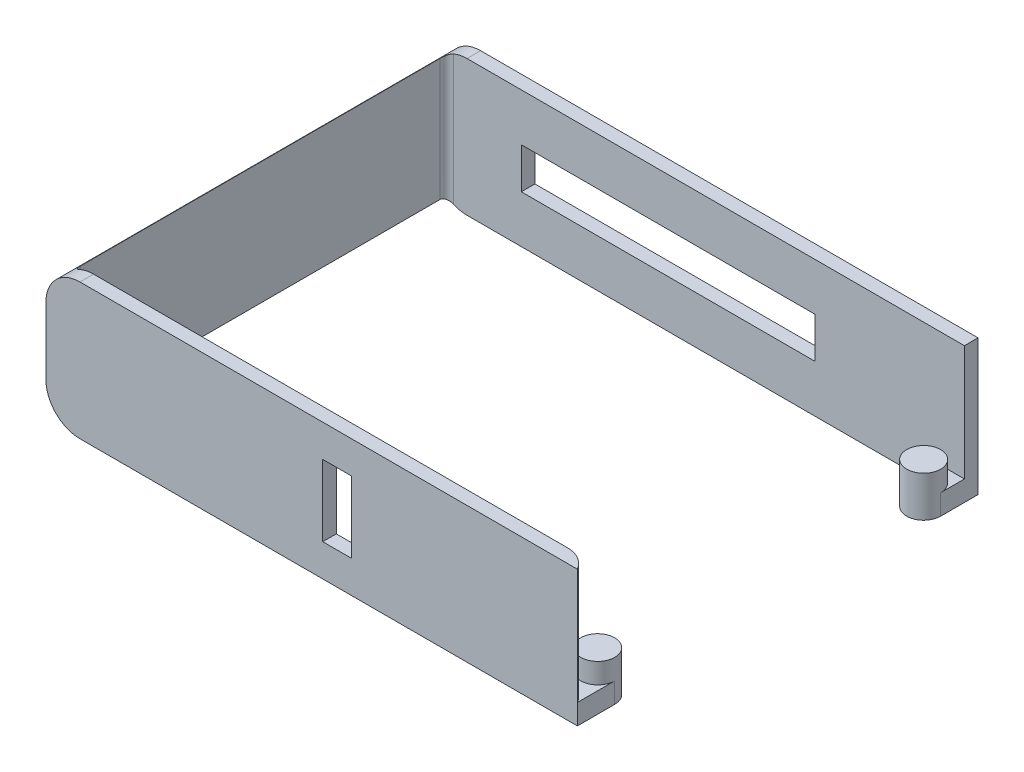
ISO-10303-21;
HEADER;
FILE_DESCRIPTION(('STEP AP214'),'2;1');
FILE_NAME('part.step','',(''),(''),'','','');
FILE_SCHEMA(('AUTOMOTIVE_DESIGN { 1 0 10303 214 1 1 1 1 }'));
ENDSEC;
DATA;
#1=APPLICATION_CONTEXT('core data for automotive mechanical design processes');
#2=APPLICATION_PROTOCOL_DEFINITION('international standard','automotive_design',2000,#1);
#3=PRODUCT_CONTEXT('',#1,'mechanical');
#4=PRODUCT('Part','Part','',(#3));
#5=PRODUCT_RELATED_PRODUCT_CATEGORY('part','',(#4));
#6=PRODUCT_DEFINITION_FORMATION('','',#4);
#7=PRODUCT_DEFINITION_CONTEXT('part definition',#1,'design');
#8=PRODUCT_DEFINITION('design','',#6,#7);
#9=PRODUCT_DEFINITION_SHAPE('','',#8);
#10=(LENGTH_UNIT() NAMED_UNIT(*) SI_UNIT(.MILLI.,.METRE.));
#11=(NAMED_UNIT(*) PLANE_ANGLE_UNIT() SI_UNIT($,.RADIAN.));
#12=(NAMED_UNIT(*) SI_UNIT($,.STERADIAN.) SOLID_ANGLE_UNIT());
#13=UNCERTAINTY_MEASURE_WITH_UNIT(LENGTH_MEASURE(1.E-05),#10,'distance_accuracy_value','');
#14=(GEOMETRIC_REPRESENTATION_CONTEXT(3) GLOBAL_UNCERTAINTY_ASSIGNED_CONTEXT((#13)) GLOBAL_UNIT_ASSIGNED_CONTEXT((#10,
#11,#12)) REPRESENTATION_CONTEXT('',''));
#15=CARTESIAN_POINT('',(0.,0.,0.));
#16=DIRECTION('',(0.,0.,1.));
#17=DIRECTION('',(1.,0.,0.));
#18=AXIS2_PLACEMENT_3D('',#15,#16,#17);
#19=CARTESIAN_POINT('',(-39.125,20.,2.));
#20=DIRECTION('',(0.,-1.,0.));
#21=DIRECTION('',(1.,0.,0.));
#22=AXIS2_PLACEMENT_3D('',#19,#20,#21);
#23=PLANE('',#22);
#24=DIRECTION('',(-1.,0.,0.));
#25=VECTOR('',#24,1.);
#26=CARTESIAN_POINT('',(-39.125,20.,0.));
#27=LINE('',#26,#25);
#28=CARTESIAN_POINT('',(39.125,20.,0.));
#29=VERTEX_POINT('',#28);
#30=CARTESIAN_POINT('',(-34.125,20.,0.));
#31=VERTEX_POINT('',#30);
#32=EDGE_CURVE('E548',#29,#31,#27,.T.);
#33=ORIENTED_EDGE('',*,*,#32,.T.);
#34=DIRECTION('',(0.,0.,-1.));
#35=VECTOR('',#34,1.);
#36=CARTESIAN_POINT('',(-34.125,20.,2.));
#37=LINE('',#36,#35);
#38=CARTESIAN_POINT('',(-34.125,20.,2.));
#39=VERTEX_POINT('',#38);
#40=EDGE_CURVE('E357',#31,#39,#37,.F.);
#41=ORIENTED_EDGE('',*,*,#40,.T.);
#42=DIRECTION('',(-1.,0.,0.));
#43=VECTOR('',#42,1.);
#44=CARTESIAN_POINT('',(-39.125,20.,2.));
#45=LINE('',#44,#43);
#46=CARTESIAN_POINT('',(39.125,20.,2.));
#47=VERTEX_POINT('',#46);
#48=EDGE_CURVE('E526',#47,#39,#45,.T.);
#49=ORIENTED_EDGE('',*,*,#48,.F.);
#50=DIRECTION('',(0.,0.,-1.));
#51=VECTOR('',#50,1.);
#52=CARTESIAN_POINT('',(39.125,20.,2.));
#53=LINE('',#52,#51);
#54=EDGE_CURVE('E533',#47,#29,#53,.T.);
#55=ORIENTED_EDGE('',*,*,#54,.T.);
#56=EDGE_LOOP('',(#33,#41,#49,#55));
#57=FACE_BOUND('',#56,.T.);
#58=ADVANCED_FACE('F27',(#57),#23,.F.);
#59=CARTESIAN_POINT('',(-39.125,0.,2.));
#60=DIRECTION('',(0.,1.,0.));
#61=DIRECTION('',(0.,0.,1.));
#62=AXIS2_PLACEMENT_3D('',#59,#60,#61);
#63=PLANE('',#62);
#64=DIRECTION('',(1.,0.,0.));
#65=VECTOR('',#64,1.);
#66=CARTESIAN_POINT('',(-39.125,0.,59.));
#67=LINE('',#66,#65);
#68=CARTESIAN_POINT('',(-34.125,0.,59.));
#69=VERTEX_POINT('',#68);
#70=CARTESIAN_POINT('',(39.125,0.,59.));
#71=VERTEX_POINT('',#70);
#72=EDGE_CURVE('E562',#69,#71,#67,.T.);
#73=ORIENTED_EDGE('',*,*,#72,.F.);
#74=DIRECTION('',(0.,0.,-1.));
#75=VECTOR('',#74,1.);
#76=CARTESIAN_POINT('',(-34.125,0.,2.));
#77=LINE('',#76,#75);
#78=CARTESIAN_POINT('',(-34.125,0.,57.));
#79=VERTEX_POINT('',#78);
#80=EDGE_CURVE('E321',#69,#79,#77,.T.);
#81=ORIENTED_EDGE('',*,*,#80,.T.);
#82=DIRECTION('',(1.,0.,0.));
#83=VECTOR('',#82,1.);
#84=CARTESIAN_POINT('',(-39.125,0.,57.));
#85=LINE('',#84,#83);
#86=CARTESIAN_POINT('',(34.125,0.,57.));
#87=VERTEX_POINT('',#86);
#88=EDGE_CURVE('E307',#79,#87,#85,.T.);
#89=ORIENTED_EDGE('',*,*,#88,.T.);
#90=DIRECTION('',(0.,0.,-1.));
#91=VECTOR('',#90,1.);
#92=CARTESIAN_POINT('',(34.125,0.,57.));
#93=LINE('',#92,#91);
#94=CARTESIAN_POINT('',(34.125,0.,53.5));
#95=VERTEX_POINT('',#94);
#96=EDGE_CURVE('E289',#87,#95,#93,.T.);
#97=ORIENTED_EDGE('',*,*,#96,.T.);
#98=CARTESIAN_POINT('',(36.625,0.,53.5));
#99=DIRECTION('',(0.,-1.,0.));
#100=DIRECTION('',(0.,0.,-1.));
#101=AXIS2_PLACEMENT_3D('',#98,#99,#100);
#102=CIRCLE('',#101,2.50000000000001);
#103=CARTESIAN_POINT('',(39.125,0.,53.5));
#104=VERTEX_POINT('',#103);
#105=EDGE_CURVE('E286',#95,#104,#102,.T.);
#106=ORIENTED_EDGE('',*,*,#105,.T.);
#107=DIRECTION('',(0.,0.,-1.));
#108=VECTOR('',#107,1.);
#109=CARTESIAN_POINT('',(39.125,0.,59.));
#110=LINE('',#109,#108);
#111=EDGE_CURVE('E476',#71,#104,#110,.T.);
#112=ORIENTED_EDGE('',*,*,#111,.F.);
#113=EDGE_LOOP('',(#73,#81,#89,#97,#106,#112));
#114=FACE_BOUND('',#113,.T.);
#115=ADVANCED_FACE('F445',(#114),#63,.F.);
#116=CARTESIAN_POINT('',(36.625,3.,5.5));
#117=DIRECTION('',(0.,1.,0.));
#118=DIRECTION('',(0.,0.,1.));
#119=AXIS2_PLACEMENT_3D('',#116,#117,#118);
#120=PLANE('',#119);
#121=DIRECTION('',(0.,0.,1.));
#122=VECTOR('',#121,1.);
#123=CARTESIAN_POINT('',(34.125,3.,2.));
#124=LINE('',#123,#122);
#125=CARTESIAN_POINT('',(34.125,3.,2.));
#126=VERTEX_POINT('',#125);
#127=CARTESIAN_POINT('',(34.125,3.,5.5));
#128=VERTEX_POINT('',#127);
#129=EDGE_CURVE('E496',#126,#128,#124,.T.);
#130=ORIENTED_EDGE('',*,*,#129,.T.);
#131=CARTESIAN_POINT('',(36.625,3.,5.5));
#132=DIRECTION('',(0.,1.,0.));
#133=DIRECTION('',(0.,0.,1.));
#134=AXIS2_PLACEMENT_3D('',#131,#132,#133);
#135=CIRCLE('',#134,2.50000000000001);
#136=CARTESIAN_POINT('',(39.125,3.,5.5));
#137=VERTEX_POINT('',#136);
#138=EDGE_CURVE('E479',#137,#128,#135,.T.);
#139=ORIENTED_EDGE('',*,*,#138,.F.);
#140=DIRECTION('',(0.,0.,-1.));
#141=VECTOR('',#140,1.);
#142=CARTESIAN_POINT('',(39.125,3.,2.));
#143=LINE('',#142,#141);
#144=CARTESIAN_POINT('',(39.125,3.,2.));
#145=VERTEX_POINT('',#144);
#146=EDGE_CURVE('E498',#137,#145,#143,.T.);
#147=ORIENTED_EDGE('',*,*,#146,.T.);
#148=DIRECTION('',(-1.,0.,0.));
#149=VECTOR('',#148,1.);
#150=CARTESIAN_POINT('',(34.125,3.,2.));
#151=LINE('',#150,#149);
#152=EDGE_CURVE('E495',#145,#126,#151,.T.);
#153=ORIENTED_EDGE('',*,*,#152,.T.);
#154=EDGE_LOOP('',(#130,#139,#147,#153));
#155=FACE_BOUND('',#154,.T.);
#156=ADVANCED_FACE('F453',(#155),#120,.T.);
#157=CARTESIAN_POINT('',(-39.125,0.,2.));
#158=DIRECTION('',(0.,0.,1.));
#159=DIRECTION('',(1.,0.,0.));
#160=AXIS2_PLACEMENT_3D('',#157,#158,#159);
#161=PLANE('',#160);
#162=DIRECTION('',(0.,-1.,0.));
#163=VECTOR('',#162,1.);
#164=CARTESIAN_POINT('',(17.125,13.,2.));
#165=LINE('',#164,#163);
#166=CARTESIAN_POINT('',(17.125,13.,2.));
#167=VERTEX_POINT('',#166);
#168=CARTESIAN_POINT('',(17.125,7.,2.));
#169=VERTEX_POINT('',#168);
#170=EDGE_CURVE('E247',#167,#169,#165,.T.);
#171=ORIENTED_EDGE('',*,*,#170,.T.);
#172=DIRECTION('',(-1.,0.,0.));
#173=VECTOR('',#172,1.);
#174=CARTESIAN_POINT('',(17.125,7.,2.));
#175=LINE('',#174,#173);
#176=CARTESIAN_POINT('',(-26.125,7.,2.));
#177=VERTEX_POINT('',#176);
#178=EDGE_CURVE('E250',#169,#177,#175,.T.);
#179=ORIENTED_EDGE('',*,*,#178,.T.);
#180=DIRECTION('',(0.,1.,0.));
#181=VECTOR('',#180,1.);
#182=CARTESIAN_POINT('',(-26.125,13.,2.));
#183=LINE('',#182,#181);
#184=CARTESIAN_POINT('',(-26.125,13.,2.));
#185=VERTEX_POINT('',#184);
#186=EDGE_CURVE('E274',#177,#185,#183,.T.);
#187=ORIENTED_EDGE('',*,*,#186,.T.);
#188=DIRECTION('',(1.,0.,0.));
#189=VECTOR('',#188,1.);
#190=CARTESIAN_POINT('',(17.125,13.,2.));
#191=LINE('',#190,#189);
#192=EDGE_CURVE('E270',#185,#167,#191,.T.);
#193=ORIENTED_EDGE('',*,*,#192,.T.);
#194=EDGE_LOOP('',(#171,#179,#187,#193));
#195=FACE_BOUND('',#194,.T.);
#196=CARTESIAN_POINT('',(-34.125,15.,2.));
#197=DIRECTION('',(0.,0.,1.));
#198=DIRECTION('',(1.,0.,0.));
#199=AXIS2_PLACEMENT_3D('',#196,#197,#198);
#200=CIRCLE('',#199,5.);
#201=CARTESIAN_POINT('',(-36.125,19.5825756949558,2.));
#202=VERTEX_POINT('',#201);
#203=EDGE_CURVE('E337',#39,#202,#200,.T.);
#204=ORIENTED_EDGE('',*,*,#203,.T.);
#205=DIRECTION('',(0.,1.,0.));
#206=VECTOR('',#205,1.);
#207=CARTESIAN_POINT('',(-36.125,0.,2.));
#208=LINE('',#207,#206);
#209=CARTESIAN_POINT('',(-36.125,0.417424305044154,2.));
#210=VERTEX_POINT('',#209);
#211=EDGE_CURVE('E367',#202,#210,#208,.F.);
#212=ORIENTED_EDGE('',*,*,#211,.T.);
#213=CARTESIAN_POINT('',(-34.125,5.,2.));
#214=DIRECTION('',(0.,0.,1.));
#215=DIRECTION('',(1.,0.,0.));
#216=AXIS2_PLACEMENT_3D('',#213,#214,#215);
#217=CIRCLE('',#216,5.);
#218=CARTESIAN_POINT('',(-34.125,0.,2.));
#219=VERTEX_POINT('',#218);
#220=EDGE_CURVE('E340',#210,#219,#217,.T.);
#221=ORIENTED_EDGE('',*,*,#220,.T.);
#222=DIRECTION('',(1.,0.,0.));
#223=VECTOR('',#222,1.);
#224=CARTESIAN_POINT('',(-39.125,0.,2.));
#225=LINE('',#224,#223);
#226=CARTESIAN_POINT('',(34.125,0.,2.));
#227=VERTEX_POINT('',#226);
#228=EDGE_CURVE('E316',#219,#227,#225,.T.);
#229=ORIENTED_EDGE('',*,*,#228,.T.);
#230=DIRECTION('',(0.,-1.,0.));
#231=VECTOR('',#230,1.);
#232=CARTESIAN_POINT('',(34.125,3.,2.));
#233=LINE('',#232,#231);
#234=EDGE_CURVE('E505',#126,#227,#233,.T.);
#235=ORIENTED_EDGE('',*,*,#234,.F.);
#236=ORIENTED_EDGE('',*,*,#152,.F.);
#237=DIRECTION('',(0.,1.,0.));
#238=VECTOR('',#237,1.);
#239=CARTESIAN_POINT('',(39.125,20.,2.));
#240=LINE('',#239,#238);
#241=EDGE_CURVE('E523',#145,#47,#240,.T.);
#242=ORIENTED_EDGE('',*,*,#241,.T.);
#243=ORIENTED_EDGE('',*,*,#48,.T.);
#244=EDGE_LOOP('',(#204,#212,#221,#229,#235,#236,#242,#243));
#245=FACE_BOUND('',#244,.T.);
#246=ADVANCED_FACE('F591',(#195,#245),#161,.T.);
#247=CARTESIAN_POINT('',(-39.125,20.,2.));
#248=DIRECTION('',(1.,0.,0.));
#249=DIRECTION('',(0.,1.,0.));
#250=AXIS2_PLACEMENT_3D('',#247,#248,#249);
#251=PLANE('',#250);
#252=DIRECTION('',(0.,-1.,0.));
#253=VECTOR('',#252,1.);
#254=CARTESIAN_POINT('',(-39.125,20.,0.));
#255=LINE('',#254,#253);
#256=CARTESIAN_POINT('',(-39.125,15.,0.));
#257=VERTEX_POINT('',#256);
#258=CARTESIAN_POINT('',(-39.125,5.,0.));
#259=VERTEX_POINT('',#258);
#260=EDGE_CURVE('E508',#257,#259,#255,.T.);
#261=ORIENTED_EDGE('',*,*,#260,.T.);
#262=DIRECTION('',(0.,0.,-1.));
#263=VECTOR('',#262,1.);
#264=CARTESIAN_POINT('',(-39.125,5.,2.));
#265=LINE('',#264,#263);
#266=CARTESIAN_POINT('',(-39.125,5.,59.));
#267=VERTEX_POINT('',#266);
#268=EDGE_CURVE('E349',#259,#267,#265,.F.);
#269=ORIENTED_EDGE('',*,*,#268,.T.);
#270=DIRECTION('',(0.,-1.,0.));
#271=VECTOR('',#270,1.);
#272=CARTESIAN_POINT('',(-39.125,0.,59.));
#273=LINE('',#272,#271);
#274=CARTESIAN_POINT('',(-39.125,15.,59.));
#275=VERTEX_POINT('',#274);
#276=EDGE_CURVE('E564',#275,#267,#273,.T.);
#277=ORIENTED_EDGE('',*,*,#276,.F.);
#278=DIRECTION('',(0.,0.,-1.));
#279=VECTOR('',#278,1.);
#280=CARTESIAN_POINT('',(-39.125,15.,2.));
#281=LINE('',#280,#279);
#282=EDGE_CURVE('E346',#275,#257,#281,.T.);
#283=ORIENTED_EDGE('',*,*,#282,.T.);
#284=EDGE_LOOP('',(#261,#269,#277,#283));
#285=FACE_BOUND('',#284,.T.);
#286=ADVANCED_FACE('F29',(#285),#251,.F.);
#287=ORIENTED_EDGE('',*,*,#228,.F.);
#288=DIRECTION('',(0.,0.,-1.));
#289=VECTOR('',#288,1.);
#290=CARTESIAN_POINT('',(-34.125,0.,2.));
#291=LINE('',#290,#289);
#292=CARTESIAN_POINT('',(-34.125,0.,0.));
#293=VERTEX_POINT('',#292);
#294=EDGE_CURVE('E319',#219,#293,#291,.T.);
#295=ORIENTED_EDGE('',*,*,#294,.T.);
#296=DIRECTION('',(1.,0.,0.));
#297=VECTOR('',#296,1.);
#298=CARTESIAN_POINT('',(-39.125,0.,0.));
#299=LINE('',#298,#297);
#300=CARTESIAN_POINT('',(39.125,0.,0.));
#301=VERTEX_POINT('',#300);
#302=EDGE_CURVE('E546',#293,#301,#299,.T.);
#303=ORIENTED_EDGE('',*,*,#302,.T.);
#304=DIRECTION('',(0.,0.,-1.));
#305=VECTOR('',#304,1.);
#306=CARTESIAN_POINT('',(39.125,0.,2.));
#307=LINE('',#306,#305);
#308=CARTESIAN_POINT('',(39.125,0.,5.5));
#309=VERTEX_POINT('',#308);
#310=EDGE_CURVE('E322',#309,#301,#307,.T.);
#311=ORIENTED_EDGE('',*,*,#310,.F.);
#312=CARTESIAN_POINT('',(36.625,0.,5.5));
#313=DIRECTION('',(0.,1.,0.));
#314=DIRECTION('',(0.,0.,1.));
#315=AXIS2_PLACEMENT_3D('',#312,#313,#314);
#316=CIRCLE('',#315,2.50000000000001);
#317=CARTESIAN_POINT('',(34.125,0.,5.5));
#318=VERTEX_POINT('',#317);
#319=EDGE_CURVE('E492',#318,#309,#316,.T.);
#320=ORIENTED_EDGE('',*,*,#319,.F.);
#321=DIRECTION('',(0.,0.,1.));
#322=VECTOR('',#321,1.);
#323=CARTESIAN_POINT('',(34.125,0.,2.));
#324=LINE('',#323,#322);
#325=EDGE_CURVE('E491',#227,#318,#324,.T.);
#326=ORIENTED_EDGE('',*,*,#325,.F.);
#327=EDGE_LOOP('',(#287,#295,#303,#311,#320,#326));
#328=FACE_BOUND('',#327,.T.);
#329=ADVANCED_FACE('F455',(#328),#63,.F.);
#330=CARTESIAN_POINT('',(39.125,20.,2.));
#331=DIRECTION('',(-1.,0.,0.));
#332=DIRECTION('',(0.,0.,1.));
#333=AXIS2_PLACEMENT_3D('',#330,#331,#332);
#334=PLANE('',#333);
#335=DIRECTION('',(0.,1.,0.));
#336=VECTOR('',#335,1.);
#337=CARTESIAN_POINT('',(39.125,20.,0.));
#338=LINE('',#337,#336);
#339=EDGE_CURVE('E540',#301,#29,#338,.T.);
#340=ORIENTED_EDGE('',*,*,#339,.T.);
#341=ORIENTED_EDGE('',*,*,#54,.F.);
#342=ORIENTED_EDGE('',*,*,#241,.F.);
#343=ORIENTED_EDGE('',*,*,#146,.F.);
#344=DIRECTION('',(0.,-1.,0.));
#345=VECTOR('',#344,1.);
#346=CARTESIAN_POINT('',(39.125,3.,5.5));
#347=LINE('',#346,#345);
#348=EDGE_CURVE('E499',#137,#309,#347,.T.);
#349=ORIENTED_EDGE('',*,*,#348,.T.);
#350=ORIENTED_EDGE('',*,*,#310,.T.);
#351=EDGE_LOOP('',(#340,#341,#342,#343,#349,#350));
#352=FACE_BOUND('',#351,.T.);
#353=ADVANCED_FACE('F461',(#352),#334,.F.);
#354=DIRECTION('',(-1.,0.,0.));
#355=VECTOR('',#354,1.);
#356=CARTESIAN_POINT('',(-39.125,20.,59.));
#357=LINE('',#356,#355);
#358=CARTESIAN_POINT('',(39.125,20.,59.));
#359=VERTEX_POINT('',#358);
#360=CARTESIAN_POINT('',(-34.125,20.,59.));
#361=VERTEX_POINT('',#360);
#362=EDGE_CURVE('E472',#359,#361,#357,.T.);
#363=ORIENTED_EDGE('',*,*,#362,.F.);
#364=CARTESIAN_POINT('',(35.6608983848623,20.,61.));
#365=DIRECTION('',(0.,-1.,0.));
#366=DIRECTION('',(1.,0.,0.));
#367=AXIS2_PLACEMENT_3D('',#364,#365,#366);
#368=CIRCLE('',#367,4.);
#369=CARTESIAN_POINT('',(35.6608983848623,20.,57.));
#370=VERTEX_POINT('',#369);
#371=EDGE_CURVE('E49',#359,#370,#368,.F.);
#372=ORIENTED_EDGE('',*,*,#371,.T.);
#373=DIRECTION('',(-1.,0.,0.));
#374=VECTOR('',#373,1.);
#375=CARTESIAN_POINT('',(-39.125,20.,57.));
#376=LINE('',#375,#374);
#377=CARTESIAN_POINT('',(-34.125,20.,57.));
#378=VERTEX_POINT('',#377);
#379=EDGE_CURVE('E315',#370,#378,#376,.T.);
#380=ORIENTED_EDGE('',*,*,#379,.T.);
#381=DIRECTION('',(0.,0.,-1.));
#382=VECTOR('',#381,1.);
#383=CARTESIAN_POINT('',(-34.125,20.,2.));
#384=LINE('',#383,#382);
#385=EDGE_CURVE('E355',#378,#361,#384,.F.);
#386=ORIENTED_EDGE('',*,*,#385,.T.);
#387=EDGE_LOOP('',(#363,#372,#380,#386));
#388=FACE_BOUND('',#387,.T.);
#389=ADVANCED_FACE('F448',(#388),#23,.F.);
#390=CARTESIAN_POINT('',(-39.125,0.,0.));
#391=DIRECTION('',(0.,0.,1.));
#392=DIRECTION('',(1.,0.,0.));
#393=AXIS2_PLACEMENT_3D('',#390,#391,#392);
#394=PLANE('',#393);
#395=DIRECTION('',(-1.,0.,0.));
#396=VECTOR('',#395,1.);
#397=CARTESIAN_POINT('',(17.125,7.,0.));
#398=LINE('',#397,#396);
#399=CARTESIAN_POINT('',(17.125,7.,0.));
#400=VERTEX_POINT('',#399);
#401=CARTESIAN_POINT('',(-26.125,7.,0.));
#402=VERTEX_POINT('',#401);
#403=EDGE_CURVE('E262',#400,#402,#398,.T.);
#404=ORIENTED_EDGE('',*,*,#403,.F.);
#405=DIRECTION('',(0.,-1.,0.));
#406=VECTOR('',#405,1.);
#407=CARTESIAN_POINT('',(17.125,13.,0.));
#408=LINE('',#407,#406);
#409=CARTESIAN_POINT('',(17.125,13.,0.));
#410=VERTEX_POINT('',#409);
#411=EDGE_CURVE('E265',#410,#400,#408,.T.);
#412=ORIENTED_EDGE('',*,*,#411,.F.);
#413=DIRECTION('',(1.,0.,0.));
#414=VECTOR('',#413,1.);
#415=CARTESIAN_POINT('',(17.125,13.,0.));
#416=LINE('',#415,#414);
#417=CARTESIAN_POINT('',(-26.125,13.,0.));
#418=VERTEX_POINT('',#417);
#419=EDGE_CURVE('E255',#418,#410,#416,.T.);
#420=ORIENTED_EDGE('',*,*,#419,.F.);
#421=DIRECTION('',(0.,1.,0.));
#422=VECTOR('',#421,1.);
#423=CARTESIAN_POINT('',(-26.125,13.,0.));
#424=LINE('',#423,#422);
#425=EDGE_CURVE('E259',#402,#418,#424,.T.);
#426=ORIENTED_EDGE('',*,*,#425,.F.);
#427=EDGE_LOOP('',(#404,#412,#420,#426));
#428=FACE_BOUND('',#427,.T.);
#429=ORIENTED_EDGE('',*,*,#302,.F.);
#430=CARTESIAN_POINT('',(-34.125,5.,0.));
#431=DIRECTION('',(0.,0.,1.));
#432=DIRECTION('',(1.,0.,0.));
#433=AXIS2_PLACEMENT_3D('',#430,#431,#432);
#434=CIRCLE('',#433,5.);
#435=EDGE_CURVE('E344',#293,#259,#434,.F.);
#436=ORIENTED_EDGE('',*,*,#435,.T.);
#437=ORIENTED_EDGE('',*,*,#260,.F.);
#438=CARTESIAN_POINT('',(-34.125,15.,0.));
#439=DIRECTION('',(0.,0.,1.));
#440=DIRECTION('',(1.,0.,0.));
#441=AXIS2_PLACEMENT_3D('',#438,#439,#440);
#442=CIRCLE('',#441,5.);
#443=EDGE_CURVE('E342',#257,#31,#442,.F.);
#444=ORIENTED_EDGE('',*,*,#443,.T.);
#445=ORIENTED_EDGE('',*,*,#32,.F.);
#446=ORIENTED_EDGE('',*,*,#339,.F.);
#447=EDGE_LOOP('',(#429,#436,#437,#444,#445,#446));
#448=FACE_BOUND('',#447,.T.);
#449=ADVANCED_FACE('F460',(#428,#448),#394,.F.);
#450=CARTESIAN_POINT('',(34.125,3.,2.));
#451=DIRECTION('',(1.,0.,0.));
#452=DIRECTION('',(0.,0.,-1.));
#453=AXIS2_PLACEMENT_3D('',#450,#451,#452);
#454=PLANE('',#453);
#455=ORIENTED_EDGE('',*,*,#325,.T.);
#456=DIRECTION('',(0.,-1.,0.));
#457=VECTOR('',#456,1.);
#458=CARTESIAN_POINT('',(34.125,3.,5.5));
#459=LINE('',#458,#457);
#460=EDGE_CURVE('E502',#128,#318,#459,.T.);
#461=ORIENTED_EDGE('',*,*,#460,.F.);
#462=ORIENTED_EDGE('',*,*,#129,.F.);
#463=ORIENTED_EDGE('',*,*,#234,.T.);
#464=EDGE_LOOP('',(#455,#461,#462,#463));
#465=FACE_BOUND('',#464,.T.);
#466=ADVANCED_FACE('F466',(#465),#454,.F.);
#467=CARTESIAN_POINT('',(36.625,3.,5.5));
#468=DIRECTION('',(0.,-1.,0.));
#469=DIRECTION('',(0.,0.,-1.));
#470=AXIS2_PLACEMENT_3D('',#467,#468,#469);
#471=CYLINDRICAL_SURFACE('',#470,2.50000000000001);
#472=ORIENTED_EDGE('',*,*,#319,.T.);
#473=ORIENTED_EDGE('',*,*,#348,.F.);
#474=ORIENTED_EDGE('',*,*,#138,.T.);
#475=ORIENTED_EDGE('',*,*,#460,.T.);
#476=EDGE_LOOP('',(#472,#473,#474,#475));
#477=FACE_BOUND('',#476,.T.);
#478=CARTESIAN_POINT('',(36.625,6.,5.5));
#479=DIRECTION('',(0.,1.,0.));
#480=DIRECTION('',(0.,0.,1.));
#481=AXIS2_PLACEMENT_3D('',#478,#479,#480);
#482=CIRCLE('',#481,2.50000000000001);
#483=CARTESIAN_POINT('',(36.625,6.,8.00000000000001));
#484=VERTEX_POINT('',#483);
#485=EDGE_CURVE('E488',#484,#484,#482,.T.);
#486=ORIENTED_EDGE('',*,*,#485,.F.);
#487=EDGE_LOOP('',(#486));
#488=FACE_BOUND('',#487,.T.);
#489=ADVANCED_FACE('F683',(#477,#488),#471,.T.);
#490=CARTESIAN_POINT('',(-37.125,20.,29.5));
#491=DIRECTION('',(-1.,0.,0.));
#492=DIRECTION('',(0.,0.,1.));
#493=AXIS2_PLACEMENT_3D('',#490,#491,#492);
#494=PLANE('',#493);
#495=DIRECTION('',(0.,0.,-1.));
#496=VECTOR('',#495,1.);
#497=CARTESIAN_POINT('',(-37.125,19.,2.));
#498=LINE('',#497,#496);
#499=CARTESIAN_POINT('',(-37.125,19.,3.));
#500=VERTEX_POINT('',#499);
#501=CARTESIAN_POINT('',(-37.125,19.,56.));
#502=VERTEX_POINT('',#501);
#503=EDGE_CURVE('E331',#500,#502,#498,.F.);
#504=ORIENTED_EDGE('',*,*,#503,.T.);
#505=DIRECTION('',(0.,1.,0.));
#506=VECTOR('',#505,1.);
#507=CARTESIAN_POINT('',(-37.125,20.,56.));
#508=LINE('',#507,#506);
#509=CARTESIAN_POINT('',(-37.125,0.999999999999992,56.));
#510=VERTEX_POINT('',#509);
#511=EDGE_CURVE('E365',#502,#510,#508,.F.);
#512=ORIENTED_EDGE('',*,*,#511,.T.);
#513=DIRECTION('',(0.,0.,-1.));
#514=VECTOR('',#513,1.);
#515=CARTESIAN_POINT('',(-37.125,0.999999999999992,57.));
#516=LINE('',#515,#514);
#517=CARTESIAN_POINT('',(-37.125,0.999999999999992,3.));
#518=VERTEX_POINT('',#517);
#519=EDGE_CURVE('E334',#510,#518,#516,.T.);
#520=ORIENTED_EDGE('',*,*,#519,.T.);
#521=DIRECTION('',(0.,1.,0.));
#522=VECTOR('',#521,1.);
#523=CARTESIAN_POINT('',(-37.125,20.,3.));
#524=LINE('',#523,#522);
#525=EDGE_CURVE('E362',#518,#500,#524,.T.);
#526=ORIENTED_EDGE('',*,*,#525,.T.);
#527=EDGE_LOOP('',(#504,#512,#520,#526));
#528=FACE_BOUND('',#527,.T.);
#529=ADVANCED_FACE('F585',(#528),#494,.F.);
#530=CARTESIAN_POINT('',(36.625,6.,5.5));
#531=DIRECTION('',(0.,1.,0.));
#532=DIRECTION('',(0.,0.,1.));
#533=AXIS2_PLACEMENT_3D('',#530,#531,#532);
#534=PLANE('',#533);
#535=ORIENTED_EDGE('',*,*,#485,.T.);
#536=EDGE_LOOP('',(#535));
#537=FACE_BOUND('',#536,.T.);
#538=ADVANCED_FACE('F702',(#537),#534,.T.);
#539=CARTESIAN_POINT('',(39.125,0.,59.));
#540=DIRECTION('',(-1.,0.,0.));
#541=DIRECTION('',(0.,0.,1.));
#542=AXIS2_PLACEMENT_3D('',#539,#540,#541);
#543=PLANE('',#542);
#544=DIRECTION('',(0.,0.,1.));
#545=VECTOR('',#544,1.);
#546=CARTESIAN_POINT('',(39.125,3.,57.));
#547=LINE('',#546,#545);
#548=CARTESIAN_POINT('',(39.125,3.,53.5));
#549=VERTEX_POINT('',#548);
#550=CARTESIAN_POINT('',(39.125,3.,59.));
#551=VERTEX_POINT('',#550);
#552=EDGE_CURVE('E294',#549,#551,#547,.T.);
#553=ORIENTED_EDGE('',*,*,#552,.T.);
#554=DIRECTION('',(0.,1.,0.));
#555=VECTOR('',#554,1.);
#556=CARTESIAN_POINT('',(39.125,0.,59.));
#557=LINE('',#556,#555);
#558=EDGE_CURVE('E477',#71,#551,#557,.T.);
#559=ORIENTED_EDGE('',*,*,#558,.F.);
#560=ORIENTED_EDGE('',*,*,#111,.T.);
#561=DIRECTION('',(0.,-1.,0.));
#562=VECTOR('',#561,1.);
#563=CARTESIAN_POINT('',(39.125,3.,53.5));
#564=LINE('',#563,#562);
#565=EDGE_CURVE('E304',#549,#104,#564,.T.);
#566=ORIENTED_EDGE('',*,*,#565,.F.);
#567=EDGE_LOOP('',(#553,#559,#560,#566));
#568=FACE_BOUND('',#567,.T.);
#569=ADVANCED_FACE('F706',(#568),#543,.F.);
#570=CARTESIAN_POINT('',(-39.125,20.,59.));
#571=DIRECTION('',(0.,0.,-1.));
#572=DIRECTION('',(-1.,0.,0.));
#573=AXIS2_PLACEMENT_3D('',#570,#571,#572);
#574=PLANE('',#573);
#575=DIRECTION('',(1.,0.,0.));
#576=VECTOR('',#575,1.);
#577=CARTESIAN_POINT('',(1.625,4.75,59.));
#578=LINE('',#577,#576);
#579=CARTESIAN_POINT('',(1.625,4.75,59.));
#580=VERTEX_POINT('',#579);
#581=CARTESIAN_POINT('',(5.875,4.75,59.));
#582=VERTEX_POINT('',#581);
#583=EDGE_CURVE('E230',#580,#582,#578,.T.);
#584=ORIENTED_EDGE('',*,*,#583,.F.);
#585=DIRECTION('',(0.,-1.,0.));
#586=VECTOR('',#585,1.);
#587=CARTESIAN_POINT('',(1.625,15.25,59.));
#588=LINE('',#587,#586);
#589=CARTESIAN_POINT('',(1.625,15.25,59.));
#590=VERTEX_POINT('',#589);
#591=EDGE_CURVE('E235',#590,#580,#588,.T.);
#592=ORIENTED_EDGE('',*,*,#591,.F.);
#593=DIRECTION('',(-1.,0.,0.));
#594=VECTOR('',#593,1.);
#595=CARTESIAN_POINT('',(1.625,15.25,59.));
#596=LINE('',#595,#594);
#597=CARTESIAN_POINT('',(5.875,15.25,59.));
#598=VERTEX_POINT('',#597);
#599=EDGE_CURVE('E240',#598,#590,#596,.T.);
#600=ORIENTED_EDGE('',*,*,#599,.F.);
#601=DIRECTION('',(0.,1.,0.));
#602=VECTOR('',#601,1.);
#603=CARTESIAN_POINT('',(5.875,15.25,59.));
#604=LINE('',#603,#602);
#605=EDGE_CURVE('E219',#582,#598,#604,.T.);
#606=ORIENTED_EDGE('',*,*,#605,.F.);
#607=EDGE_LOOP('',(#584,#592,#600,#606));
#608=FACE_BOUND('',#607,.T.);
#609=ORIENTED_EDGE('',*,*,#276,.T.);
#610=CARTESIAN_POINT('',(-34.125,5.,59.));
#611=DIRECTION('',(0.,0.,-1.));
#612=DIRECTION('',(-1.,0.,0.));
#613=AXIS2_PLACEMENT_3D('',#610,#611,#612);
#614=CIRCLE('',#613,5.);
#615=EDGE_CURVE('E353',#267,#69,#614,.F.);
#616=ORIENTED_EDGE('',*,*,#615,.T.);
#617=ORIENTED_EDGE('',*,*,#72,.T.);
#618=ORIENTED_EDGE('',*,*,#558,.T.);
#619=EDGE_CURVE('E482',#551,#359,#557,.T.);
#620=ORIENTED_EDGE('',*,*,#619,.T.);
#621=ORIENTED_EDGE('',*,*,#362,.T.);
#622=CARTESIAN_POINT('',(-34.125,15.,59.));
#623=DIRECTION('',(0.,0.,-1.));
#624=DIRECTION('',(-1.,0.,0.));
#625=AXIS2_PLACEMENT_3D('',#622,#623,#624);
#626=CIRCLE('',#625,5.);
#627=EDGE_CURVE('E351',#361,#275,#626,.F.);
#628=ORIENTED_EDGE('',*,*,#627,.T.);
#629=EDGE_LOOP('',(#609,#616,#617,#618,#620,#621,#628));
#630=FACE_BOUND('',#629,.T.);
#631=ADVANCED_FACE('F237',(#608,#630),#574,.F.);
#632=CARTESIAN_POINT('',(-39.125,20.,57.));
#633=DIRECTION('',(0.,0.,-1.));
#634=DIRECTION('',(-1.,0.,0.));
#635=AXIS2_PLACEMENT_3D('',#632,#633,#634);
#636=PLANE('',#635);
#637=DIRECTION('',(0.,1.,0.));
#638=VECTOR('',#637,1.);
#639=CARTESIAN_POINT('',(1.625,20.,57.));
#640=LINE('',#639,#638);
#641=CARTESIAN_POINT('',(1.625,4.75,57.));
#642=VERTEX_POINT('',#641);
#643=CARTESIAN_POINT('',(1.625,15.25,57.));
#644=VERTEX_POINT('',#643);
#645=EDGE_CURVE('E570',#642,#644,#640,.T.);
#646=ORIENTED_EDGE('',*,*,#645,.F.);
#647=DIRECTION('',(-1.,0.,0.));
#648=VECTOR('',#647,1.);
#649=CARTESIAN_POINT('',(-39.125,4.75,57.));
#650=LINE('',#649,#648);
#651=CARTESIAN_POINT('',(5.875,4.75,57.));
#652=VERTEX_POINT('',#651);
#653=EDGE_CURVE('E576',#652,#642,#650,.T.);
#654=ORIENTED_EDGE('',*,*,#653,.F.);
#655=DIRECTION('',(0.,-1.,0.));
#656=VECTOR('',#655,1.);
#657=CARTESIAN_POINT('',(5.875,20.,57.));
#658=LINE('',#657,#656);
#659=CARTESIAN_POINT('',(5.875,15.25,57.));
#660=VERTEX_POINT('',#659);
#661=EDGE_CURVE('E222',#660,#652,#658,.T.);
#662=ORIENTED_EDGE('',*,*,#661,.F.);
#663=DIRECTION('',(1.,0.,0.));
#664=VECTOR('',#663,1.);
#665=CARTESIAN_POINT('',(-39.125,15.25,57.));
#666=LINE('',#665,#664);
#667=EDGE_CURVE('E572',#644,#660,#666,.T.);
#668=ORIENTED_EDGE('',*,*,#667,.F.);
#669=EDGE_LOOP('',(#646,#654,#662,#668));
#670=FACE_BOUND('',#669,.T.);
#671=ORIENTED_EDGE('',*,*,#379,.F.);
#672=DIRECTION('',(0.,1.,0.));
#673=VECTOR('',#672,1.);
#674=CARTESIAN_POINT('',(35.6608983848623,3.,57.));
#675=LINE('',#674,#673);
#676=CARTESIAN_POINT('',(35.6608983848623,3.,57.));
#677=VERTEX_POINT('',#676);
#678=EDGE_CURVE('E35',#370,#677,#675,.F.);
#679=ORIENTED_EDGE('',*,*,#678,.T.);
#680=DIRECTION('',(-1.,0.,0.));
#681=VECTOR('',#680,1.);
#682=CARTESIAN_POINT('',(34.125,3.,57.));
#683=LINE('',#682,#681);
#684=CARTESIAN_POINT('',(34.125,3.,57.));
#685=VERTEX_POINT('',#684);
#686=EDGE_CURVE('E292',#677,#685,#683,.T.);
#687=ORIENTED_EDGE('',*,*,#686,.T.);
#688=DIRECTION('',(0.,-1.,0.));
#689=VECTOR('',#688,1.);
#690=CARTESIAN_POINT('',(34.125,3.,57.));
#691=LINE('',#690,#689);
#692=EDGE_CURVE('E299',#685,#87,#691,.T.);
#693=ORIENTED_EDGE('',*,*,#692,.T.);
#694=ORIENTED_EDGE('',*,*,#88,.F.);
#695=CARTESIAN_POINT('',(-34.125,5.,57.));
#696=DIRECTION('',(0.,0.,-1.));
#697=DIRECTION('',(-1.,0.,0.));
#698=AXIS2_PLACEMENT_3D('',#695,#696,#697);
#699=CIRCLE('',#698,5.);
#700=CARTESIAN_POINT('',(-36.125,0.417424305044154,57.));
#701=VERTEX_POINT('',#700);
#702=EDGE_CURVE('E328',#79,#701,#699,.T.);
#703=ORIENTED_EDGE('',*,*,#702,.T.);
#704=DIRECTION('',(0.,1.,0.));
#705=VECTOR('',#704,1.);
#706=CARTESIAN_POINT('',(-36.125,20.,57.));
#707=LINE('',#706,#705);
#708=CARTESIAN_POINT('',(-36.125,19.5825756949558,57.));
#709=VERTEX_POINT('',#708);
#710=EDGE_CURVE('E359',#701,#709,#707,.T.);
#711=ORIENTED_EDGE('',*,*,#710,.T.);
#712=CARTESIAN_POINT('',(-34.125,15.,57.));
#713=DIRECTION('',(0.,0.,-1.));
#714=DIRECTION('',(-1.,0.,0.));
#715=AXIS2_PLACEMENT_3D('',#712,#713,#714);
#716=CIRCLE('',#715,5.);
#717=EDGE_CURVE('E325',#709,#378,#716,.T.);
#718=ORIENTED_EDGE('',*,*,#717,.T.);
#719=EDGE_LOOP('',(#671,#679,#687,#693,#694,#703,#711,#718));
#720=FACE_BOUND('',#719,.T.);
#721=ADVANCED_FACE('F594',(#670,#720),#636,.T.);
#722=CARTESIAN_POINT('',(36.625,3.,53.5));
#723=DIRECTION('',(0.,-1.,0.));
#724=DIRECTION('',(0.,0.,-1.));
#725=AXIS2_PLACEMENT_3D('',#722,#723,#724);
#726=CYLINDRICAL_SURFACE('',#725,2.50000000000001);
#727=ORIENTED_EDGE('',*,*,#105,.F.);
#728=DIRECTION('',(0.,-1.,0.));
#729=VECTOR('',#728,1.);
#730=CARTESIAN_POINT('',(34.125,3.,53.5));
#731=LINE('',#730,#729);
#732=CARTESIAN_POINT('',(34.125,3.,53.5));
#733=VERTEX_POINT('',#732);
#734=EDGE_CURVE('E302',#733,#95,#731,.T.);
#735=ORIENTED_EDGE('',*,*,#734,.F.);
#736=CARTESIAN_POINT('',(36.625,3.,53.5));
#737=DIRECTION('',(0.,-1.,0.));
#738=DIRECTION('',(0.,0.,-1.));
#739=AXIS2_PLACEMENT_3D('',#736,#737,#738);
#740=CIRCLE('',#739,2.50000000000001);
#741=EDGE_CURVE('E258',#549,#733,#740,.T.);
#742=ORIENTED_EDGE('',*,*,#741,.F.);
#743=ORIENTED_EDGE('',*,*,#565,.T.);
#744=EDGE_LOOP('',(#727,#735,#742,#743));
#745=FACE_BOUND('',#744,.T.);
#746=CARTESIAN_POINT('',(36.625,6.,53.5));
#747=DIRECTION('',(0.,-1.,0.));
#748=DIRECTION('',(0.,0.,-1.));
#749=AXIS2_PLACEMENT_3D('',#746,#747,#748);
#750=CIRCLE('',#749,2.50000000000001);
#751=CARTESIAN_POINT('',(36.625,6.,51.));
#752=VERTEX_POINT('',#751);
#753=EDGE_CURVE('E283',#752,#752,#750,.T.);
#754=ORIENTED_EDGE('',*,*,#753,.T.);
#755=EDGE_LOOP('',(#754));
#756=FACE_BOUND('',#755,.T.);
#757=ADVANCED_FACE('F788',(#745,#756),#726,.T.);
#758=CARTESIAN_POINT('',(34.125,3.,57.));
#759=DIRECTION('',(-1.,0.,0.));
#760=DIRECTION('',(0.,0.,1.));
#761=AXIS2_PLACEMENT_3D('',#758,#759,#760);
#762=PLANE('',#761);
#763=ORIENTED_EDGE('',*,*,#96,.F.);
#764=ORIENTED_EDGE('',*,*,#692,.F.);
#765=DIRECTION('',(0.,0.,-1.));
#766=VECTOR('',#765,1.);
#767=CARTESIAN_POINT('',(34.125,3.,57.));
#768=LINE('',#767,#766);
#769=EDGE_CURVE('E296',#685,#733,#768,.T.);
#770=ORIENTED_EDGE('',*,*,#769,.T.);
#771=ORIENTED_EDGE('',*,*,#734,.T.);
#772=EDGE_LOOP('',(#763,#764,#770,#771));
#773=FACE_BOUND('',#772,.T.);
#774=ADVANCED_FACE('F793',(#773),#762,.T.);
#775=CARTESIAN_POINT('',(36.625,3.,53.5));
#776=DIRECTION('',(0.,1.,0.));
#777=DIRECTION('',(0.,0.,-1.));
#778=AXIS2_PLACEMENT_3D('',#775,#776,#777);
#779=PLANE('',#778);
#780=ORIENTED_EDGE('',*,*,#741,.T.);
#781=ORIENTED_EDGE('',*,*,#769,.F.);
#782=ORIENTED_EDGE('',*,*,#686,.F.);
#783=CARTESIAN_POINT('',(35.6608983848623,3.,61.));
#784=DIRECTION('',(0.,1.,0.));
#785=DIRECTION('',(0.,0.,1.));
#786=AXIS2_PLACEMENT_3D('',#783,#784,#785);
#787=CIRCLE('',#786,4.);
#788=EDGE_CURVE('E11',#677,#551,#787,.F.);
#789=ORIENTED_EDGE('',*,*,#788,.T.);
#790=ORIENTED_EDGE('',*,*,#552,.F.);
#791=EDGE_LOOP('',(#780,#781,#782,#789,#790));
#792=FACE_BOUND('',#791,.T.);
#793=ADVANCED_FACE('F784',(#792),#779,.T.);
#794=CARTESIAN_POINT('',(36.625,6.,53.5));
#795=DIRECTION('',(0.,1.,0.));
#796=DIRECTION('',(0.,0.,-1.));
#797=AXIS2_PLACEMENT_3D('',#794,#795,#796);
#798=PLANE('',#797);
#799=ORIENTED_EDGE('',*,*,#753,.F.);
#800=EDGE_LOOP('',(#799));
#801=FACE_BOUND('',#800,.T.);
#802=ADVANCED_FACE('F744',(#801),#798,.T.);
#803=CARTESIAN_POINT('',(-34.125,5.,2.));
#804=DIRECTION('',(0.,0.,-1.));
#805=DIRECTION('',(-1.,0.,0.));
#806=AXIS2_PLACEMENT_3D('',#803,#804,#805);
#807=CYLINDRICAL_SURFACE('',#806,5.);
#808=ORIENTED_EDGE('',*,*,#615,.F.);
#809=ORIENTED_EDGE('',*,*,#268,.F.);
#810=ORIENTED_EDGE('',*,*,#435,.F.);
#811=ORIENTED_EDGE('',*,*,#294,.F.);
#812=ORIENTED_EDGE('',*,*,#220,.F.);
#813=CARTESIAN_POINT('',(-36.125,0.417424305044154,2.));
#814=CARTESIAN_POINT('',(-36.1564177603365,0.4311339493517,2.00000152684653));
#815=CARTESIAN_POINT('',(-36.1876724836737,0.445161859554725,2.00148090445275));
#816=CARTESIAN_POINT('',(-36.2496553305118,0.473743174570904,2.00731134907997));
#817=CARTESIAN_POINT('',(-36.2803836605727,0.488296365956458,2.01166126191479));
#818=CARTESIAN_POINT('',(-36.3713720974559,0.532524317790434,2.02886545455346));
#819=CARTESIAN_POINT('',(-36.4305864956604,0.56283350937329,2.04587501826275));
#820=CARTESIAN_POINT('',(-36.544572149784,0.623944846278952,2.09021915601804));
#821=CARTESIAN_POINT('',(-36.5993490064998,0.654746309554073,2.11754046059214));
#822=CARTESIAN_POINT('',(-36.703401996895,0.715670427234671,2.18195510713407));
#823=CARTESIAN_POINT('',(-36.752670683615,0.745792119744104,2.21906145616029));
#824=CARTESIAN_POINT('',(-36.8452877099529,0.804394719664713,2.30343720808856));
#825=CARTESIAN_POINT('',(-36.8884824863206,0.832825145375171,2.35091167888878));
#826=CARTESIAN_POINT('',(-36.9658260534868,0.88516267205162,2.45485459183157));
#827=CARTESIAN_POINT('',(-36.9999951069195,0.909079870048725,2.51130242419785));
#828=CARTESIAN_POINT('',(-37.0485434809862,0.943708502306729,2.61367843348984));
#829=CARTESIAN_POINT('',(-37.0657834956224,0.956227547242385,2.65765093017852));
#830=CARTESIAN_POINT('',(-37.0940142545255,0.976908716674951,2.74848661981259));
#831=CARTESIAN_POINT('',(-37.1050197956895,0.985081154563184,2.79534267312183));
#832=CARTESIAN_POINT('',(-37.1167069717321,0.993790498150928,2.86883439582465));
#833=CARTESIAN_POINT('',(-37.1198083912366,0.99611019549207,2.89490211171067));
#834=CARTESIAN_POINT('',(-37.1239574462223,0.999217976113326,2.94730756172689));
#835=CARTESIAN_POINT('',(-37.1250037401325,1.00000505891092,2.97364546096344));
#836=CARTESIAN_POINT('',(-37.125,0.999999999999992,3.));
#837=B_SPLINE_CURVE_WITH_KNOTS('',3,(#813,#814,#815,#816,#817,#818,#819,#820,#821,#822,#823,
#824,#825,#826,#827,#828,#829,#830,#831,#832,#833,#834,#835,#836),.UNSPECIFIED.,.F.,.F.,(4,2,2,
2,2,2,2,2,2,2,2,4),(0.,0.10276204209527,0.205482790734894,0.410436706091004,0.615127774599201,
0.820092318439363,1.02955263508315,1.23853864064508,1.38454984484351,1.53021303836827,
1.60916135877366,1.68816119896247),.UNSPECIFIED.);
#838=EDGE_CURVE('E398',#210,#518,#837,.T.);
#839=ORIENTED_EDGE('',*,*,#838,.T.);
#840=ORIENTED_EDGE('',*,*,#519,.F.);
#841=CARTESIAN_POINT('',(-37.125,0.999999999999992,56.));
#842=CARTESIAN_POINT('',(-37.1250024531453,1.00000344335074,56.0245723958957));
#843=CARTESIAN_POINT('',(-37.124093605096,0.999320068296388,56.0491304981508));
#844=CARTESIAN_POINT('',(-37.1204853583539,0.996617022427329,56.0980250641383));
#845=CARTESIAN_POINT('',(-37.1177871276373,0.994598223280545,56.1223616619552));
#846=CARTESIAN_POINT('',(-37.1071091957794,0.98663400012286,56.1944295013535));
#847=CARTESIAN_POINT('',(-37.0965451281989,0.978779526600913,56.2415990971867));
#848=CARTESIAN_POINT('',(-37.0691627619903,0.958689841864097,56.3329122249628));
#849=CARTESIAN_POINT('',(-37.0523586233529,0.946464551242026,56.3770623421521));
#850=CARTESIAN_POINT('',(-37.0132517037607,0.918507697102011,56.4617219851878));
#851=CARTESIAN_POINT('',(-36.9909398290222,0.902770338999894,56.5022253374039));
#852=CARTESIAN_POINT('',(-36.9393505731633,0.867144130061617,56.5825057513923));
#853=CARTESIAN_POINT('',(-36.9096245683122,0.847008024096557,56.6218826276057));
#854=CARTESIAN_POINT('',(-36.8454152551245,0.804666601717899,56.6952563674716));
#855=CARTESIAN_POINT('',(-36.8109300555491,0.78246046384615,56.7292510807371));
#856=CARTESIAN_POINT('',(-36.7310526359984,0.732553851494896,56.7974647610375));
#857=CARTESIAN_POINT('',(-36.684827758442,0.704603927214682,56.8305304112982));
#858=CARTESIAN_POINT('',(-36.5877175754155,0.648197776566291,56.8883067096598));
#859=CARTESIAN_POINT('',(-36.5368308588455,0.619741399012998,56.9130148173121));
#860=CARTESIAN_POINT('',(-36.4275410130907,0.56126124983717,56.9550559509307));
#861=CARTESIAN_POINT('',(-36.3688604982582,0.531272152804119,56.971729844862));
#862=CARTESIAN_POINT('',(-36.2787508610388,0.487519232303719,56.988584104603));
#863=CARTESIAN_POINT('',(-36.248339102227,0.473128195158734,56.9928429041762));
#864=CARTESIAN_POINT('',(-36.1870050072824,0.444862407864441,56.9985504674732));
#865=CARTESIAN_POINT('',(-36.1560825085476,0.430987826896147,56.9999983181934));
#866=CARTESIAN_POINT('',(-36.125,0.417424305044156,57.));
#867=B_SPLINE_CURVE_WITH_KNOTS('',3,(#841,#842,#843,#844,#845,#846,#847,#848,#849,#850,#851,
#852,#853,#854,#855,#856,#857,#858,#859,#860,#861,#862,#863,#864,#865,#866),.UNSPECIFIED.,.F.,
.F.,(4,2,2,2,2,2,2,2,2,2,2,2,4),(0.,0.0736637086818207,0.147279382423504,0.293386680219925,
0.439164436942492,0.585184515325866,0.744468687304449,0.903816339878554,1.09304470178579,
1.28233053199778,1.48524562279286,1.58687821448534,1.68854381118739),.UNSPECIFIED.);
#868=EDGE_CURVE('E376',#510,#701,#867,.T.);
#869=ORIENTED_EDGE('',*,*,#868,.T.);
#870=ORIENTED_EDGE('',*,*,#702,.F.);
#871=ORIENTED_EDGE('',*,*,#80,.F.);
#872=EDGE_LOOP('',(#808,#809,#810,#811,#812,#839,#840,#869,#870,#871));
#873=FACE_BOUND('',#872,.T.);
#874=ADVANCED_FACE('F388',(#873),#807,.T.);
#875=CARTESIAN_POINT('',(-34.125,15.,2.));
#876=DIRECTION('',(0.,0.,-1.));
#877=DIRECTION('',(-1.,0.,0.));
#878=AXIS2_PLACEMENT_3D('',#875,#876,#877);
#879=CYLINDRICAL_SURFACE('',#878,5.);
#880=ORIENTED_EDGE('',*,*,#203,.F.);
#881=ORIENTED_EDGE('',*,*,#40,.F.);
#882=ORIENTED_EDGE('',*,*,#443,.F.);
#883=ORIENTED_EDGE('',*,*,#282,.F.);
#884=ORIENTED_EDGE('',*,*,#627,.F.);
#885=ORIENTED_EDGE('',*,*,#385,.F.);
#886=ORIENTED_EDGE('',*,*,#717,.F.);
#887=CARTESIAN_POINT('',(-36.125,19.5825756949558,57.));
#888=CARTESIAN_POINT('',(-36.1564177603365,19.5688660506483,56.9999984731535));
#889=CARTESIAN_POINT('',(-36.1876724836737,19.5548381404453,56.9985190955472));
#890=CARTESIAN_POINT('',(-36.2496553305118,19.5262568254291,56.99268865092));
#891=CARTESIAN_POINT('',(-36.2803836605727,19.5117036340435,56.9883387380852));
#892=CARTESIAN_POINT('',(-36.3713720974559,19.4674756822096,56.9711345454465));
#893=CARTESIAN_POINT('',(-36.4305864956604,19.4371664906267,56.9541249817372));
#894=CARTESIAN_POINT('',(-36.544572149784,19.376055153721,56.909780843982));
#895=CARTESIAN_POINT('',(-36.5993490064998,19.3452536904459,56.8824595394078));
#896=CARTESIAN_POINT('',(-36.7034019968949,19.2843295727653,56.8180448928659));
#897=CARTESIAN_POINT('',(-36.752670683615,19.2542078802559,56.7809385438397));
#898=CARTESIAN_POINT('',(-36.8452877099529,19.1956052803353,56.6965627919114));
#899=CARTESIAN_POINT('',(-36.8884824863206,19.1671748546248,56.6490883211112));
#900=CARTESIAN_POINT('',(-36.9658260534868,19.1148373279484,56.5451454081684));
#901=CARTESIAN_POINT('',(-36.9999951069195,19.0909201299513,56.4886975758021));
#902=CARTESIAN_POINT('',(-37.0485434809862,19.0562914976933,56.3863215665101));
#903=CARTESIAN_POINT('',(-37.0657834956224,19.0437724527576,56.3423490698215));
#904=CARTESIAN_POINT('',(-37.0940142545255,19.023091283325,56.2515133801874));
#905=CARTESIAN_POINT('',(-37.1050197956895,19.0149188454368,56.2046573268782));
#906=CARTESIAN_POINT('',(-37.1167069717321,19.0062095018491,56.1311656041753));
#907=CARTESIAN_POINT('',(-37.1198083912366,19.0038898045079,56.1050978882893));
#908=CARTESIAN_POINT('',(-37.1239574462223,19.0007820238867,56.0526924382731));
#909=CARTESIAN_POINT('',(-37.1250037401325,18.9999949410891,56.0263545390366));
#910=CARTESIAN_POINT('',(-37.125,19.,56.));
#911=B_SPLINE_CURVE_WITH_KNOTS('',3,(#887,#888,#889,#890,#891,#892,#893,#894,#895,#896,#897,
#898,#899,#900,#901,#902,#903,#904,#905,#906,#907,#908,#909,#910),.UNSPECIFIED.,.F.,.F.,(4,2,2,
2,2,2,2,2,2,2,2,4),(0.,0.10276204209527,0.205482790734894,0.410436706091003,0.615127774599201,
0.820092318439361,1.02955263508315,1.23853864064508,1.38454984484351,1.53021303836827,
1.60916135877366,1.68816119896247),.UNSPECIFIED.);
#912=EDGE_CURVE('E369',#709,#502,#911,.T.);
#913=ORIENTED_EDGE('',*,*,#912,.T.);
#914=ORIENTED_EDGE('',*,*,#503,.F.);
#915=CARTESIAN_POINT('',(-37.125,19.,3.));
#916=CARTESIAN_POINT('',(-37.1250024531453,18.9999965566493,2.97542760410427));
#917=CARTESIAN_POINT('',(-37.124093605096,19.0006799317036,2.9508695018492));
#918=CARTESIAN_POINT('',(-37.1204853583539,19.0033829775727,2.90197493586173));
#919=CARTESIAN_POINT('',(-37.1177871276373,19.0054017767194,2.8776383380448));
#920=CARTESIAN_POINT('',(-37.1071091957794,19.0133659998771,2.8055704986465));
#921=CARTESIAN_POINT('',(-37.0965451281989,19.0212204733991,2.75840090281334));
#922=CARTESIAN_POINT('',(-37.0691627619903,19.0413101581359,2.6670877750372));
#923=CARTESIAN_POINT('',(-37.0523586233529,19.053535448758,2.62293765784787));
#924=CARTESIAN_POINT('',(-37.0132517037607,19.081492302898,2.53827801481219));
#925=CARTESIAN_POINT('',(-36.9909398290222,19.0972296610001,2.49777466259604));
#926=CARTESIAN_POINT('',(-36.9393505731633,19.1328558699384,2.41749424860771));
#927=CARTESIAN_POINT('',(-36.9096245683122,19.1529919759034,2.37811737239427));
#928=CARTESIAN_POINT('',(-36.8454152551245,19.1953333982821,2.30474363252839));
#929=CARTESIAN_POINT('',(-36.8109300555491,19.2175395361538,2.27074891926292));
#930=CARTESIAN_POINT('',(-36.7310526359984,19.2674461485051,2.20253523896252));
#931=CARTESIAN_POINT('',(-36.684827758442,19.2953960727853,2.16946958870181));
#932=CARTESIAN_POINT('',(-36.5877175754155,19.3518022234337,2.11169329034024));
#933=CARTESIAN_POINT('',(-36.5368308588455,19.380258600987,2.08698518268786));
#934=CARTESIAN_POINT('',(-36.4275410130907,19.4387387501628,2.04494404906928));
#935=CARTESIAN_POINT('',(-36.3688604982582,19.4687278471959,2.02827015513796));
#936=CARTESIAN_POINT('',(-36.2787508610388,19.5124807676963,2.01141589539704));
#937=CARTESIAN_POINT('',(-36.248339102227,19.5268718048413,2.00715709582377));
#938=CARTESIAN_POINT('',(-36.1870050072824,19.5551375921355,2.00144953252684));
#939=CARTESIAN_POINT('',(-36.1560825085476,19.5690121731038,2.00000168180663));
#940=CARTESIAN_POINT('',(-36.125,19.5825756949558,2.));
#941=B_SPLINE_CURVE_WITH_KNOTS('',3,(#915,#916,#917,#918,#919,#920,#921,#922,#923,#924,#925,
#926,#927,#928,#929,#930,#931,#932,#933,#934,#935,#936,#937,#938,#939,#940),.UNSPECIFIED.,.F.,
.F.,(4,2,2,2,2,2,2,2,2,2,2,2,4),(0.,0.0736637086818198,0.147279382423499,0.293386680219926,
0.439164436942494,0.585184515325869,0.74446868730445,0.903816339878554,1.09304470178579,
1.28233053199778,1.48524562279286,1.58687821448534,1.68854381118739),.UNSPECIFIED.);
#942=EDGE_CURVE('E393',#500,#202,#941,.T.);
#943=ORIENTED_EDGE('',*,*,#942,.T.);
#944=EDGE_LOOP('',(#880,#881,#882,#883,#884,#885,#886,#913,#914,#943));
#945=FACE_BOUND('',#944,.T.);
#946=ADVANCED_FACE('F385',(#945),#879,.T.);
#947=CARTESIAN_POINT('',(-36.125,20.,56.));
#948=DIRECTION('',(0.,1.,0.));
#949=DIRECTION('',(0.,0.,1.));
#950=AXIS2_PLACEMENT_3D('',#947,#948,#949);
#951=CYLINDRICAL_SURFACE('',#950,1.);
#952=ORIENTED_EDGE('',*,*,#868,.F.);
#953=ORIENTED_EDGE('',*,*,#511,.F.);
#954=ORIENTED_EDGE('',*,*,#912,.F.);
#955=ORIENTED_EDGE('',*,*,#710,.F.);
#956=EDGE_LOOP('',(#952,#953,#954,#955));
#957=FACE_BOUND('',#956,.T.);
#958=ADVANCED_FACE('F382',(#957),#951,.F.);
#959=CARTESIAN_POINT('',(-36.125,20.,3.));
#960=DIRECTION('',(0.,1.,0.));
#961=DIRECTION('',(0.,0.,1.));
#962=AXIS2_PLACEMENT_3D('',#959,#960,#961);
#963=CYLINDRICAL_SURFACE('',#962,1.);
#964=ORIENTED_EDGE('',*,*,#838,.F.);
#965=ORIENTED_EDGE('',*,*,#211,.F.);
#966=ORIENTED_EDGE('',*,*,#942,.F.);
#967=ORIENTED_EDGE('',*,*,#525,.F.);
#968=EDGE_LOOP('',(#964,#965,#966,#967));
#969=FACE_BOUND('',#968,.T.);
#970=ADVANCED_FACE('F403',(#969),#963,.F.);
#971=CARTESIAN_POINT('',(17.125,13.,59.001));
#972=DIRECTION('',(1.,0.,0.));
#973=DIRECTION('',(0.,0.,-1.));
#974=AXIS2_PLACEMENT_3D('',#971,#972,#973);
#975=PLANE('',#974);
#976=DIRECTION('',(0.,0.,-1.));
#977=VECTOR('',#976,1.);
#978=CARTESIAN_POINT('',(17.125,13.,59.001));
#979=LINE('',#978,#977);
#980=EDGE_CURVE('E273',#167,#410,#979,.T.);
#981=ORIENTED_EDGE('',*,*,#980,.T.);
#982=ORIENTED_EDGE('',*,*,#411,.T.);
#983=DIRECTION('',(0.,0.,-1.));
#984=VECTOR('',#983,1.);
#985=CARTESIAN_POINT('',(17.125,7.,59.001));
#986=LINE('',#985,#984);
#987=EDGE_CURVE('E269',#169,#400,#986,.T.);
#988=ORIENTED_EDGE('',*,*,#987,.F.);
#989=ORIENTED_EDGE('',*,*,#170,.F.);
#990=EDGE_LOOP('',(#981,#982,#988,#989));
#991=FACE_BOUND('',#990,.T.);
#992=ADVANCED_FACE('F407',(#991),#975,.F.);
#993=CARTESIAN_POINT('',(17.125,13.,59.001));
#994=DIRECTION('',(0.,1.,0.));
#995=DIRECTION('',(0.,0.,1.));
#996=AXIS2_PLACEMENT_3D('',#993,#994,#995);
#997=PLANE('',#996);
#998=DIRECTION('',(0.,0.,-1.));
#999=VECTOR('',#998,1.);
#1000=CARTESIAN_POINT('',(-26.125,13.,59.001));
#1001=LINE('',#1000,#999);
#1002=EDGE_CURVE('E254',#185,#418,#1001,.T.);
#1003=ORIENTED_EDGE('',*,*,#1002,.T.);
#1004=ORIENTED_EDGE('',*,*,#419,.T.);
#1005=ORIENTED_EDGE('',*,*,#980,.F.);
#1006=ORIENTED_EDGE('',*,*,#192,.F.);
#1007=EDGE_LOOP('',(#1003,#1004,#1005,#1006));
#1008=FACE_BOUND('',#1007,.T.);
#1009=ADVANCED_FACE('F412',(#1008),#997,.F.);
#1010=CARTESIAN_POINT('',(-26.125,13.,59.001));
#1011=DIRECTION('',(-1.,0.,0.));
#1012=DIRECTION('',(0.,0.,1.));
#1013=AXIS2_PLACEMENT_3D('',#1010,#1011,#1012);
#1014=PLANE('',#1013);
#1015=DIRECTION('',(0.,0.,-1.));
#1016=VECTOR('',#1015,1.);
#1017=CARTESIAN_POINT('',(-26.125,7.,59.001));
#1018=LINE('',#1017,#1016);
#1019=EDGE_CURVE('E253',#177,#402,#1018,.T.);
#1020=ORIENTED_EDGE('',*,*,#1019,.T.);
#1021=ORIENTED_EDGE('',*,*,#425,.T.);
#1022=ORIENTED_EDGE('',*,*,#1002,.F.);
#1023=ORIENTED_EDGE('',*,*,#186,.F.);
#1024=EDGE_LOOP('',(#1020,#1021,#1022,#1023));
#1025=FACE_BOUND('',#1024,.T.);
#1026=ADVANCED_FACE('F416',(#1025),#1014,.F.);
#1027=CARTESIAN_POINT('',(17.125,7.,59.001));
#1028=DIRECTION('',(0.,-1.,0.));
#1029=DIRECTION('',(0.,0.,-1.));
#1030=AXIS2_PLACEMENT_3D('',#1027,#1028,#1029);
#1031=PLANE('',#1030);
#1032=ORIENTED_EDGE('',*,*,#987,.T.);
#1033=ORIENTED_EDGE('',*,*,#403,.T.);
#1034=ORIENTED_EDGE('',*,*,#1019,.F.);
#1035=ORIENTED_EDGE('',*,*,#178,.F.);
#1036=EDGE_LOOP('',(#1032,#1033,#1034,#1035));
#1037=FACE_BOUND('',#1036,.T.);
#1038=ADVANCED_FACE('F420',(#1037),#1031,.F.);
#1039=CARTESIAN_POINT('',(1.625,15.25,49.));
#1040=DIRECTION('',(-1.,0.,0.));
#1041=DIRECTION('',(0.,-1.,0.));
#1042=AXIS2_PLACEMENT_3D('',#1039,#1040,#1041);
#1043=PLANE('',#1042);
#1044=ORIENTED_EDGE('',*,*,#645,.T.);
#1045=DIRECTION('',(0.,0.,1.));
#1046=VECTOR('',#1045,1.);
#1047=CARTESIAN_POINT('',(1.625,15.25,49.));
#1048=LINE('',#1047,#1046);
#1049=EDGE_CURVE('E245',#644,#590,#1048,.T.);
#1050=ORIENTED_EDGE('',*,*,#1049,.T.);
#1051=ORIENTED_EDGE('',*,*,#591,.T.);
#1052=DIRECTION('',(0.,0.,1.));
#1053=VECTOR('',#1052,1.);
#1054=CARTESIAN_POINT('',(1.625,4.75,49.));
#1055=LINE('',#1054,#1053);
#1056=EDGE_CURVE('E226',#642,#580,#1055,.T.);
#1057=ORIENTED_EDGE('',*,*,#1056,.F.);
#1058=EDGE_LOOP('',(#1044,#1050,#1051,#1057));
#1059=FACE_BOUND('',#1058,.T.);
#1060=ADVANCED_FACE('F424',(#1059),#1043,.F.);
#1061=CARTESIAN_POINT('',(1.625,15.25,49.));
#1062=DIRECTION('',(0.,1.,0.));
#1063=DIRECTION('',(0.,0.,1.));
#1064=AXIS2_PLACEMENT_3D('',#1061,#1062,#1063);
#1065=PLANE('',#1064);
#1066=ORIENTED_EDGE('',*,*,#667,.T.);
#1067=DIRECTION('',(0.,0.,1.));
#1068=VECTOR('',#1067,1.);
#1069=CARTESIAN_POINT('',(5.875,15.25,49.));
#1070=LINE('',#1069,#1068);
#1071=EDGE_CURVE('E225',#660,#598,#1070,.T.);
#1072=ORIENTED_EDGE('',*,*,#1071,.T.);
#1073=ORIENTED_EDGE('',*,*,#599,.T.);
#1074=ORIENTED_EDGE('',*,*,#1049,.F.);
#1075=EDGE_LOOP('',(#1066,#1072,#1073,#1074));
#1076=FACE_BOUND('',#1075,.T.);
#1077=ADVANCED_FACE('F428',(#1076),#1065,.F.);
#1078=CARTESIAN_POINT('',(5.875,15.25,49.));
#1079=DIRECTION('',(1.,0.,0.));
#1080=DIRECTION('',(0.,1.,0.));
#1081=AXIS2_PLACEMENT_3D('',#1078,#1079,#1080);
#1082=PLANE('',#1081);
#1083=ORIENTED_EDGE('',*,*,#661,.T.);
#1084=DIRECTION('',(0.,0.,1.));
#1085=VECTOR('',#1084,1.);
#1086=CARTESIAN_POINT('',(5.875,4.75,49.));
#1087=LINE('',#1086,#1085);
#1088=EDGE_CURVE('E214',#652,#582,#1087,.T.);
#1089=ORIENTED_EDGE('',*,*,#1088,.T.);
#1090=ORIENTED_EDGE('',*,*,#605,.T.);
#1091=ORIENTED_EDGE('',*,*,#1071,.F.);
#1092=EDGE_LOOP('',(#1083,#1089,#1090,#1091));
#1093=FACE_BOUND('',#1092,.T.);
#1094=ADVANCED_FACE('F216',(#1093),#1082,.F.);
#1095=CARTESIAN_POINT('',(1.625,4.75,49.));
#1096=DIRECTION('',(0.,-1.,0.));
#1097=DIRECTION('',(0.,0.,-1.));
#1098=AXIS2_PLACEMENT_3D('',#1095,#1096,#1097);
#1099=PLANE('',#1098);
#1100=ORIENTED_EDGE('',*,*,#653,.T.);
#1101=ORIENTED_EDGE('',*,*,#1056,.T.);
#1102=ORIENTED_EDGE('',*,*,#583,.T.);
#1103=ORIENTED_EDGE('',*,*,#1088,.F.);
#1104=EDGE_LOOP('',(#1100,#1101,#1102,#1103));
#1105=FACE_BOUND('',#1104,.T.);
#1106=ADVANCED_FACE('F231',(#1105),#1099,.F.);
#1107=CARTESIAN_POINT('',(35.6608983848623,0.,61.));
#1108=DIRECTION('',(0.,-1.,0.));
#1109=DIRECTION('',(0.,0.,-1.));
#1110=AXIS2_PLACEMENT_3D('',#1107,#1108,#1109);
#1111=CYLINDRICAL_SURFACE('',#1110,4.);
#1112=ORIENTED_EDGE('',*,*,#788,.F.);
#1113=ORIENTED_EDGE('',*,*,#678,.F.);
#1114=ORIENTED_EDGE('',*,*,#371,.F.);
#1115=ORIENTED_EDGE('',*,*,#619,.F.);
#1116=EDGE_LOOP('',(#1112,#1113,#1114,#1115));
#1117=FACE_BOUND('',#1116,.T.);
#1118=ADVANCED_FACE('F432',(#1117),#1111,.T.);
#1119=CLOSED_SHELL('',(#58,#115,#156,#246,#286,#329,#353,#389,#449,#466,#489,#529,#538,#569,
#631,#721,#757,#774,#793,#802,#874,#946,#958,#970,#992,#1009,#1026,#1038,#1060,#1077,#1094,
#1106,#1118));
#1120=MANIFOLD_SOLID_BREP('B2',#1119);
#1121=ADVANCED_BREP_SHAPE_REPRESENTATION('',(#18,#1120),#14);
#1122=SHAPE_DEFINITION_REPRESENTATION(#9,#1121);
ENDSEC;
END-ISO-10303-21;
